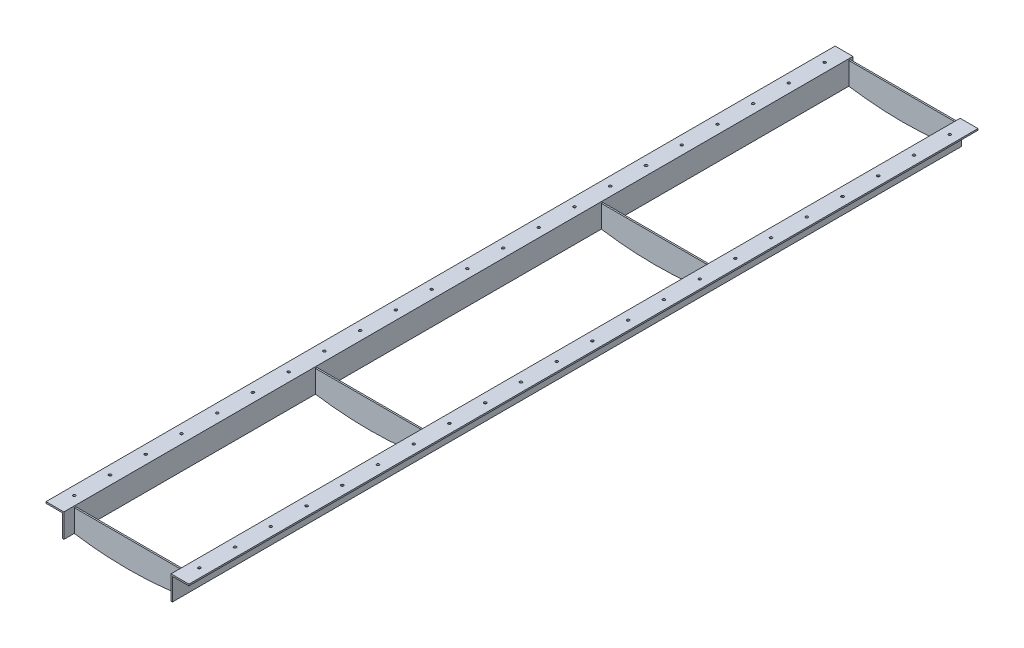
from build123d import *

# Parameters (mm, degrees)
BOSS_EXTRUDE1_DEPTH            = 3365.5
F_7_16_0_4375_DIAMETER_HOLE1_D = 11.1125
LPATTERN1_COUNT                = 22
LPATTERN1_PITCH                = 152.4
SKETCH4_W                      = 6.35
SKETCH4_H                      = 127
BOSS_EXTRUDE2_DEPTH            = 228.6
CUT_EXTRUDE1_DEPTH             = 3410.021614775


with BuildPart() as part:
    # Sketch1 → Boss-Extrude1 (new body)
    with BuildSketch(Plane.XY):
        Polygon((0, 101.6), (0, 0), (6.35, 0), (6.35, 95.25), (76.2, 95.25), (76.2, 101.6), align=None)
    extrude(amount=-BOSS_EXTRUDE1_DEPTH)

    # 7_16 _0.4375_ Diameter Hole1 (through all)
    with Locations(Plane(origin=(0, 101.6, 0), x_dir=(1, 0, 0), z_dir=(0, 1, 0))):
        with Locations((38.1, 82.55)):
            f_7_16_0_4375_diameter_hole1 = Hole(F_7_16_0_4375_DIAMETER_HOLE1_D / 2)

    # LPattern1: 7_16 _0.4375_ Diameter Hole1 ×22
    with Locations(*[(0, 0, -i * LPATTERN1_PITCH) for i in range(1, LPATTERN1_COUNT)]):
        add(f_7_16_0_4375_diameter_hole1, mode=Mode.SUBTRACT)


with BuildPart() as body_2:
    # Mirror2: mirrored copy
    add(part.part.mirror(Plane(origin=(-228.6, 0, 0), x_dir=(0, 0, 1), z_dir=(1, 0, 0))))


with BuildPart() as part_1:
    add(part.part)

    add(body_2.part)  # Boss-Extrude2 merges body 2
    # Sketch4 → Boss-Extrude2 (add, symmetric)
    with BuildSketch(Plane(origin=(-228.6, 0, 0), x_dir=(0, 0, -1), z_dir=(1, 0, 0))):
        with Locations((47.625, 31.75)):
            Rectangle(SKETCH4_W, SKETCH4_H)
        with Locations((1076.325, 31.75)):
            Rectangle(SKETCH4_W, SKETCH4_H)
        with Locations((2295.525, 31.75)):
            Rectangle(SKETCH4_W, SKETCH4_H)
        with Locations((3351.2125, 31.75)):
            Rectangle(SKETCH4_W, SKETCH4_H)
    extrude(amount=BOSS_EXTRUDE2_DEPTH, both=True)

    # Sketch5 → Cut-Extrude1 (cut, through all)
    with BuildSketch(Plane.XY):
        with BuildLine():
            Line((-584.2, 24.831312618), (-584.2, -51.368687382))
            Line((-584.2, -51.368687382), (127, -51.368687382))
            Line((127, -51.368687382), (127, 24.831312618))
            ThreePointArc((127, 24.831312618), (-228.6, -17.4625), (-584.2, 24.831312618))
        make_face()
    extrude(amount=-CUT_EXTRUDE1_DEPTH, mode=Mode.SUBTRACT)


solid = part_1.part
